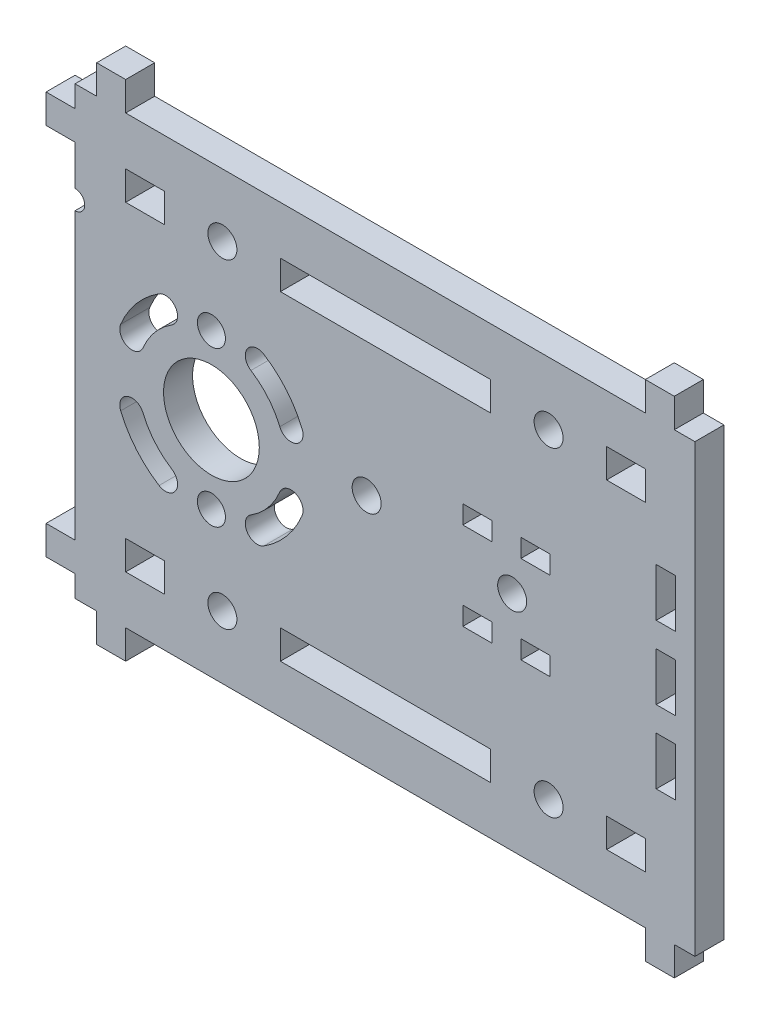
from build123d import *

# Parameters (mm, degrees)
MODEL_R             = 4.950133
MODEL_R_2           = 1.45002
MODEL_R_3           = 1.45
MODEL_R_4           = 1.5
MODEL_W             = 4
MODEL_H             = 3
MODEL_W_2           = 21.736231
MODEL_W_3           = 3
MODEL_H_2           = 1.9
MODEL_W_4           = 2
MODEL_H_3           = 5
BOSS_EXTRUDE1_DEPTH = 3


with BuildPart() as part:
    # Model → Boss-Extrude1 (new body)
    with BuildSketch(Plane.XY):
        with BuildLine():
            Line((203.813907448, 138.878433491), (203.813907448, 92.778433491))
            Line((203.813907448, 92.778433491), (201.682022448, 92.778433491))
            Line((201.682022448, 92.778433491), (201.682022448, 89.778433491))
            Line((201.682022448, 89.778433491), (198.682022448, 89.778433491))
            Line((198.682022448, 89.778433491), (198.682022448, 92.778433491))
            Line((198.682022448, 92.778433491), (144.945791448, 92.778433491))
            Line((144.945791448, 92.778433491), (144.945791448, 89.778433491))
            Line((144.945791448, 89.778433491), (141.945791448, 89.778433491))
            Line((141.945791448, 89.778433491), (141.945791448, 92.778433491))
            Line((141.945791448, 92.778433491), (139.713907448, 92.778433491))
            Line((139.713907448, 92.778433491), (139.713907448, 95.010333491))
            Line((139.713907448, 95.010333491), (136.713907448, 95.010333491))
            Line((136.713907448, 95.010333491), (136.713907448, 98.010333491))
            Line((136.713907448, 98.010333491), (139.713907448, 98.010333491))
            Line((139.713907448, 98.010333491), (139.713907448, 127.514314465))
            ThreePointArc((139.713907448, 127.514314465), (140.713907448, 128.514314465), (139.713907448, 129.514314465))
            Line((139.713907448, 129.514314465), (139.713907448, 133.646533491))
            Line((139.713907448, 133.646533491), (136.713907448, 133.646533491))
            Line((136.713907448, 133.646533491), (136.713907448, 136.646533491))
            Line((136.713907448, 136.646533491), (139.713907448, 136.646533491))
            Line((139.713907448, 136.646533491), (139.713907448, 138.878433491))
            Line((139.713907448, 138.878433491), (141.945791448, 138.878433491))
            Line((141.945791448, 138.878433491), (141.945791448, 141.878433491))
            Line((141.945791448, 141.878433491), (144.945791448, 141.878433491))
            Line((144.945791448, 141.878433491), (144.945791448, 138.878433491))
            Line((144.945791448, 138.878433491), (198.682022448, 138.878433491))
            Line((198.682022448, 138.878433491), (198.682022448, 141.878433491))
            Line((198.682022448, 141.878433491), (201.682022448, 141.878433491))
            Line((201.682022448, 141.878433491), (201.682022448, 138.878433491))
            Line((201.682022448, 138.878433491), (203.813907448, 138.878433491))
        make_face()
        with Locations((153.813907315, 115.828433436)):
            Circle(MODEL_R, mode=Mode.SUBTRACT)
        with Locations((153.813907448, 123.828433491)):
            Circle(MODEL_R_2, mode=Mode.SUBTRACT)
        with Locations((153.813907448, 107.828433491)):
            Circle(MODEL_R_3, mode=Mode.SUBTRACT)
        with Locations((188.682022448, 132.378433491)):
            Circle(MODEL_R_4, mode=Mode.SUBTRACT)
        with Locations((154.945791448, 132.378433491)):
            Circle(MODEL_R_4, mode=Mode.SUBTRACT)
        with Locations((188.682022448, 99.278433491)):
            Circle(MODEL_R_4, mode=Mode.SUBTRACT)
        with Locations((154.945791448, 99.278433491)):
            Circle(MODEL_R_4, mode=Mode.SUBTRACT)
        with Locations((184.913907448, 115.828433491)):
            Circle(MODEL_R_4, mode=Mode.SUBTRACT)
        with Locations((169.865515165, 117.075786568)):
            Circle(MODEL_R_4, mode=Mode.SUBTRACT)
        with Locations((146.945791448, 132.378433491)):
            Rectangle(MODEL_W, MODEL_H, mode=Mode.SUBTRACT)
        with Locations((171.813906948, 132.378433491)):
            Rectangle(MODEL_W_2, MODEL_H, mode=Mode.SUBTRACT)
        with Locations((196.682022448, 132.378433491)):
            Rectangle(MODEL_W, MODEL_H, mode=Mode.SUBTRACT)
        with Locations((146.945791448, 99.278433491)):
            Rectangle(MODEL_W, MODEL_H, mode=Mode.SUBTRACT)
        with Locations((171.813906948, 99.278433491)):
            Rectangle(MODEL_W_2, MODEL_H, mode=Mode.SUBTRACT)
        with Locations((196.682022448, 99.278433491)):
            Rectangle(MODEL_W, MODEL_H, mode=Mode.SUBTRACT)
        with Locations((187.31394279, 120.369524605)):
            Rectangle(MODEL_W_3, MODEL_H_2, mode=Mode.SUBTRACT)
        with Locations((181.31394279, 120.369524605)):
            Rectangle(MODEL_W_3, MODEL_H_2, mode=Mode.SUBTRACT)
        with Locations((187.31394279, 111.287342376)):
            Rectangle(MODEL_W_3, MODEL_H_2, mode=Mode.SUBTRACT)
        with Locations((181.31394279, 111.287342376)):
            Rectangle(MODEL_W_3, MODEL_H_2, mode=Mode.SUBTRACT)
        with Locations((200.813907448, 123.378433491)):
            Rectangle(MODEL_W_4, MODEL_H_3, mode=Mode.SUBTRACT)
        with Locations((200.813907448, 115.828433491)):
            Rectangle(MODEL_W_4, MODEL_H_3, mode=Mode.SUBTRACT)
        with Locations((200.813907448, 108.278433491)):
            Rectangle(MODEL_W_4, MODEL_H_3, mode=Mode.SUBTRACT)
        with BuildLine():
            ThreePointArc((148.396772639, 124.411973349), (146.050108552, 122.366470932), (144.433753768, 119.70596164))
            ThreePointArc((144.433753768, 119.70596164), (145.11141696, 118.073242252), (146.744136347, 118.750905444))
            ThreePointArc((146.744136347, 118.750905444), (147.962374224, 120.756116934), (149.731042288, 122.297801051))
            ThreePointArc((149.731042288, 122.297801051), (150.120993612, 124.022022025), (148.396772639, 124.411973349))
        make_face(mode=Mode.SUBTRACT)
        with BuildLine():
            ThreePointArc((144.433754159, 111.950905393), (146.050108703, 109.290396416), (148.396772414, 107.244894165))
            ThreePointArc((148.396772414, 107.244894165), (150.120993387, 107.634845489), (149.731042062, 109.359066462))
            ThreePointArc((149.731042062, 109.359066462), (147.962374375, 110.900750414), (146.744136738, 112.905961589))
            ThreePointArc((146.744136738, 112.905961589), (145.111417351, 113.583624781), (144.433754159, 111.950905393))
        make_face(mode=Mode.SUBTRACT)
        with BuildLine():
            ThreePointArc((163.194060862, 119.70596164), (161.577706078, 122.366470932), (159.231041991, 124.411973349))
            ThreePointArc((159.231041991, 124.411973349), (157.506821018, 124.022022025), (157.896772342, 122.297801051))
            ThreePointArc((157.896772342, 122.297801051), (159.665440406, 120.756116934), (160.883678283, 118.750905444))
            ThreePointArc((160.883678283, 118.750905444), (162.51639767, 118.073242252), (163.194060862, 119.70596164))
        make_face(mode=Mode.SUBTRACT)
        with BuildLine():
            ThreePointArc((157.896772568, 109.359066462), (159.665440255, 110.900750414), (160.883677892, 112.905961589))
            ThreePointArc((160.883677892, 112.905961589), (162.516397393, 113.583624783), (163.194060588, 111.950905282))
            ThreePointArc((163.194060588, 111.950905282), (161.577705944, 109.290396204), (159.231042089, 107.244893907))
            ThreePointArc((159.231042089, 107.244893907), (157.506821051, 107.634845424), (157.896772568, 109.359066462))
        make_face(mode=Mode.SUBTRACT)
    extrude(amount=BOSS_EXTRUDE1_DEPTH)


solid = part.part
